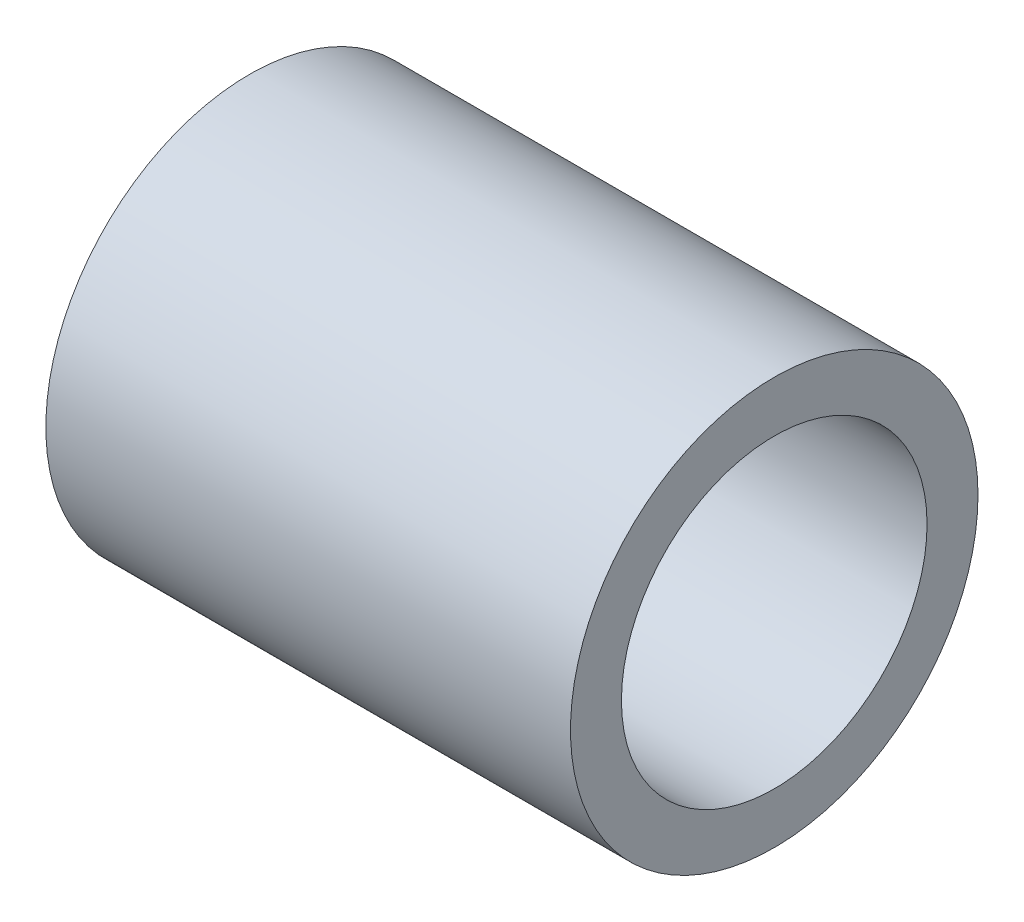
ISO-10303-21;
HEADER;
FILE_DESCRIPTION(('STEP AP214'),'2;1');
FILE_NAME('part.step','',(''),(''),'','','');
FILE_SCHEMA(('AUTOMOTIVE_DESIGN { 1 0 10303 214 1 1 1 1 }'));
ENDSEC;
DATA;
#1=APPLICATION_CONTEXT('core data for automotive mechanical design processes');
#2=APPLICATION_PROTOCOL_DEFINITION('international standard','automotive_design',2000,#1);
#3=PRODUCT_CONTEXT('',#1,'mechanical');
#4=PRODUCT('Part','Part','',(#3));
#5=PRODUCT_RELATED_PRODUCT_CATEGORY('part','',(#4));
#6=PRODUCT_DEFINITION_FORMATION('','',#4);
#7=PRODUCT_DEFINITION_CONTEXT('part definition',#1,'design');
#8=PRODUCT_DEFINITION('design','',#6,#7);
#9=PRODUCT_DEFINITION_SHAPE('','',#8);
#10=(LENGTH_UNIT() NAMED_UNIT(*) SI_UNIT(.MILLI.,.METRE.));
#11=(NAMED_UNIT(*) PLANE_ANGLE_UNIT() SI_UNIT($,.RADIAN.));
#12=(NAMED_UNIT(*) SI_UNIT($,.STERADIAN.) SOLID_ANGLE_UNIT());
#13=UNCERTAINTY_MEASURE_WITH_UNIT(LENGTH_MEASURE(1.E-05),#10,'distance_accuracy_value','');
#14=(GEOMETRIC_REPRESENTATION_CONTEXT(3) GLOBAL_UNCERTAINTY_ASSIGNED_CONTEXT((#13)) GLOBAL_UNIT_ASSIGNED_CONTEXT((#10,
#11,#12)) REPRESENTATION_CONTEXT('',''));
#15=CARTESIAN_POINT('',(0.,0.,0.));
#16=DIRECTION('',(0.,0.,1.));
#17=DIRECTION('',(1.,0.,0.));
#18=AXIS2_PLACEMENT_3D('',#15,#16,#17);
#19=CARTESIAN_POINT('',(-20.,22.,0.));
#20=DIRECTION('',(1.,0.,0.));
#21=DIRECTION('',(0.,0.,-1.));
#22=AXIS2_PLACEMENT_3D('',#19,#20,#21);
#23=CYLINDRICAL_SURFACE('',#22,4.00000000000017);
#24=CARTESIAN_POINT('',(-20.,22.,0.));
#25=DIRECTION('',(1.,0.,0.));
#26=DIRECTION('',(0.,0.,-1.));
#27=AXIS2_PLACEMENT_3D('',#24,#25,#26);
#28=CIRCLE('',#27,4.00000000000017);
#29=CARTESIAN_POINT('',(-20.,22.,-4.00000000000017));
#30=VERTEX_POINT('',#29);
#31=EDGE_CURVE('E367',#30,#30,#28,.T.);
#32=ORIENTED_EDGE('',*,*,#31,.T.);
#33=EDGE_LOOP('',(#32));
#34=FACE_BOUND('',#33,.T.);
#35=CARTESIAN_POINT('',(-9.7,22.,0.));
#36=DIRECTION('',(1.,0.,0.));
#37=DIRECTION('',(0.,0.,-1.));
#38=AXIS2_PLACEMENT_3D('',#35,#36,#37);
#39=CIRCLE('',#38,4.00000000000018);
#40=CARTESIAN_POINT('',(-9.7,22.,-4.00000000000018));
#41=VERTEX_POINT('',#40);
#42=EDGE_CURVE('E10',#41,#41,#39,.T.);
#43=ORIENTED_EDGE('',*,*,#42,.F.);
#44=EDGE_LOOP('',(#43));
#45=FACE_BOUND('',#44,.T.);
#46=ADVANCED_FACE('F348',(#34,#45),#23,.T.);
#47=CARTESIAN_POINT('',(-9.7,25.0000000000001,0.));
#48=DIRECTION('',(1.,0.,0.));
#49=DIRECTION('',(0.,0.,-1.));
#50=AXIS2_PLACEMENT_3D('',#47,#48,#49);
#51=PLANE('',#50);
#52=ORIENTED_EDGE('',*,*,#42,.T.);
#53=EDGE_LOOP('',(#52));
#54=FACE_BOUND('',#53,.T.);
#55=CARTESIAN_POINT('',(-9.7,22.,0.));
#56=DIRECTION('',(1.,0.,0.));
#57=DIRECTION('',(0.,0.,-1.));
#58=AXIS2_PLACEMENT_3D('',#55,#56,#57);
#59=CIRCLE('',#58,3.00000000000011);
#60=CARTESIAN_POINT('',(-9.7,22.,-3.00000000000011));
#61=VERTEX_POINT('',#60);
#62=EDGE_CURVE('E354',#61,#61,#59,.T.);
#63=ORIENTED_EDGE('',*,*,#62,.F.);
#64=EDGE_LOOP('',(#63));
#65=FACE_BOUND('',#64,.T.);
#66=ADVANCED_FACE('F385',(#54,#65),#51,.T.);
#67=CARTESIAN_POINT('',(-20.,22.,0.));
#68=DIRECTION('',(1.,0.,0.));
#69=DIRECTION('',(0.,0.,-1.));
#70=AXIS2_PLACEMENT_3D('',#67,#68,#69);
#71=CYLINDRICAL_SURFACE('',#70,3.00000000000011);
#72=ORIENTED_EDGE('',*,*,#62,.T.);
#73=EDGE_LOOP('',(#72));
#74=FACE_BOUND('',#73,.T.);
#75=CARTESIAN_POINT('',(-19.5,22.,0.));
#76=DIRECTION('',(1.,0.,0.));
#77=DIRECTION('',(0.,0.,-1.));
#78=AXIS2_PLACEMENT_3D('',#75,#76,#77);
#79=CIRCLE('',#78,3.00000000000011);
#80=CARTESIAN_POINT('',(-19.5,22.,-3.00000000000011));
#81=VERTEX_POINT('',#80);
#82=EDGE_CURVE('E358',#81,#81,#79,.T.);
#83=ORIENTED_EDGE('',*,*,#82,.F.);
#84=EDGE_LOOP('',(#83));
#85=FACE_BOUND('',#84,.T.);
#86=ADVANCED_FACE('F381',(#74,#85),#71,.F.);
#87=CARTESIAN_POINT('',(-20.,22.,0.));
#88=DIRECTION('',(-1.,0.,0.));
#89=DIRECTION('',(0.,0.,1.));
#90=AXIS2_PLACEMENT_3D('',#87,#88,#89);
#91=CONICAL_SURFACE('',#90,3.49999999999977,0.785398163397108);
#92=ORIENTED_EDGE('',*,*,#82,.T.);
#93=EDGE_LOOP('',(#92));
#94=FACE_BOUND('',#93,.T.);
#95=CARTESIAN_POINT('',(-20.,22.,0.));
#96=DIRECTION('',(1.,0.,0.));
#97=DIRECTION('',(0.,0.,-1.));
#98=AXIS2_PLACEMENT_3D('',#95,#96,#97);
#99=CIRCLE('',#98,3.49999999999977);
#100=CARTESIAN_POINT('',(-20.,22.,-3.49999999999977));
#101=VERTEX_POINT('',#100);
#102=EDGE_CURVE('E362',#101,#101,#99,.T.);
#103=ORIENTED_EDGE('',*,*,#102,.F.);
#104=EDGE_LOOP('',(#103));
#105=FACE_BOUND('',#104,.T.);
#106=ADVANCED_FACE('F375',(#94,#105),#91,.F.);
#107=CARTESIAN_POINT('',(-20.,26.0000000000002,0.));
#108=DIRECTION('',(-1.,0.,0.));
#109=DIRECTION('',(0.,0.,1.));
#110=AXIS2_PLACEMENT_3D('',#107,#108,#109);
#111=PLANE('',#110);
#112=ORIENTED_EDGE('',*,*,#102,.T.);
#113=EDGE_LOOP('',(#112));
#114=FACE_BOUND('',#113,.T.);
#115=ORIENTED_EDGE('',*,*,#31,.F.);
#116=EDGE_LOOP('',(#115));
#117=FACE_BOUND('',#116,.T.);
#118=ADVANCED_FACE('F373',(#114,#117),#111,.T.);
#119=CLOSED_SHELL('',(#46,#66,#86,#106,#118));
#120=MANIFOLD_SOLID_BREP('B2',#119);
#121=ADVANCED_BREP_SHAPE_REPRESENTATION('',(#18,#120),#14);
#122=SHAPE_DEFINITION_REPRESENTATION(#9,#121);
ENDSEC;
END-ISO-10303-21;
